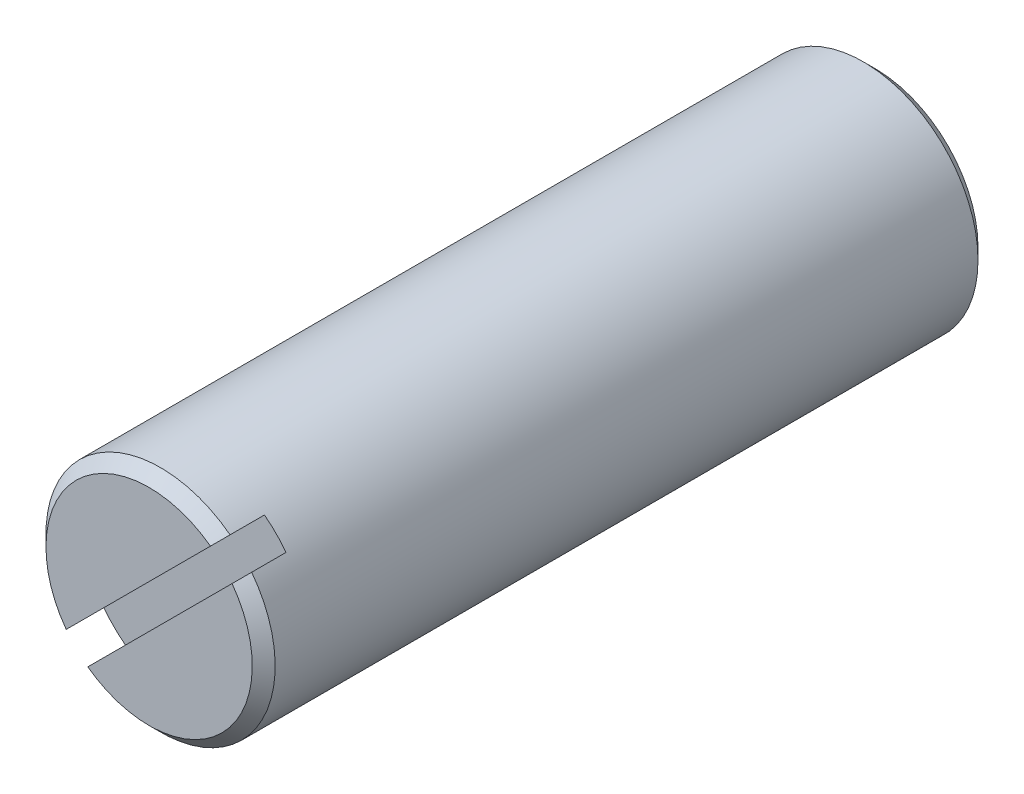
from build123d import *

# Parameters (mm, degrees)
ESQUISSE1_R          = 15
BASE_EXTRUSION_DEPTH = 95
CHANFREIN1_SIZE      = 1.5
ESQUISSE2_W          = 55
ESQUISSE2_H          = 5
M_PLAT_DEPTH         = 101.747208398
RAINURE_DEPTH        = 6


with BuildPart() as part:
    # Esquisse1 → Base-Extrusion (new body)
    with BuildSketch(Plane.XY):
        Circle(ESQUISSE1_R)
    extrude(amount=BASE_EXTRUSION_DEPTH)

    # Chanfrein1
    chanfrein1_edges = [part.edges().sort_by_distance(p)[0] for p in [
        (-15, 0, 0),
        (-15, 0, 95),
    ]]
    chamfer(chanfrein1_edges, length=CHANFREIN1_SIZE)

    # Esquisse2 → M_plat (cut, through all)
    with BuildSketch(Plane(origin=(15, 0, 0), x_dir=(0, 0, -1), z_dir=(1, 0, 0))):
        with Locations((-47.5, -15.5)):
            Rectangle(ESQUISSE2_W, ESQUISSE2_H)
    extrude(amount=-M_PLAT_DEPTH, mode=Mode.SUBTRACT)

    # Esquisse3 → Rainure (cut)
    with BuildSketch(Plane.XY.offset(95)):
        Polygon((-10.960155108, -13.788582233), (13.788582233, 10.960155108), (10.960155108, 13.788582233), (-13.788582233, -10.960155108), align=None)
    extrude(amount=-RAINURE_DEPTH, mode=Mode.SUBTRACT)


solid = part.part
